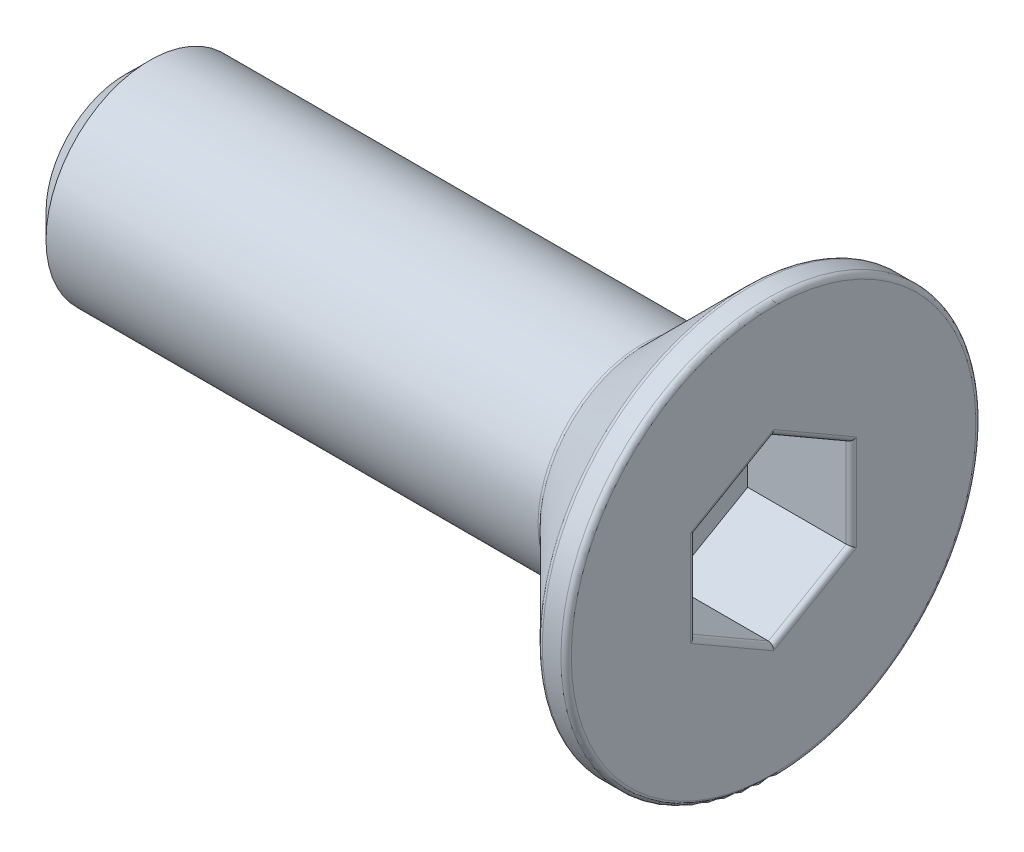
from build123d import *

# Parameters (mm, degrees)
ENL_V_MAT_EXTRU_1_DEPTH = 2
CONG_1_R                = 0.1


with BuildPart() as part:
    # Esquisse1 → R_volution1 (revolve)
    with BuildSketch(Plane.XY, mode=Mode.PRIVATE) as r_volution1_sk:
        Polygon((0, 0), (0, 2), (14, 2), (16, 4), (16.5, 4), (16.5, 0), align=None)
    revolve(r_volution1_sk.sketch.rotate(Axis((0, 0, 0), (1, 0, 0)), 90), axis=Axis((0, 0, 0), (1, 0, 0)))

    # Esquisse2 → Enl_v. mat.-Extru.1 (cut)
    with BuildSketch(Plane(origin=(16.5, 0, 0), x_dir=(0, 0, -1), z_dir=(1, 0, 0))):
        Polygon((0, -1.732050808), (1.5, -0.866025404), (1.5, 0.866025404), (0, 1.732050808), (-1.5, 0.866025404), (-1.5, -0.866025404), align=None)
    extrude(amount=-ENL_V_MAT_EXTRU_1_DEPTH, mode=Mode.SUBTRACT)

    # Esquisse5 → Enl_vement de mati_re-R_volution1 (revolve, cut)
    with BuildSketch(Plane.XY, mode=Mode.PRIVATE) as enl_vement_de_mati_re_r_volution1_sk:
        Polygon((4.747772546, 2.274154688), (-0.693244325, 2.274154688), (-0.693244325, 0), (4, 0), (4, 1.526382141), align=None)
    revolve(enl_vement_de_mati_re_r_volution1_sk.sketch.rotate(Axis((0, 0, 0), (1, 0, 0)), 90), axis=Axis((0, 0, 0), (1, 0, 0)), mode=Mode.SUBTRACT)

    # Cong_1
    cong_1_edges = [part.edges().sort_by_distance(p)[0] for p in [
        (14, 0, -2),
        (16, 0, -4),
        (16.5, 0, -4),
        (16.5, -1.299038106, -0.75),
        (16.5, 0, -1.5),
        (16.5, 1.299038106, -0.75),
        (16.5, 1.299038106, 0.75),
        (16.5, 0, 1.5),
        (16.5, -1.299038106, 0.75),
    ]]
    fillet(cong_1_edges, radius=CONG_1_R)


solid = part.part
